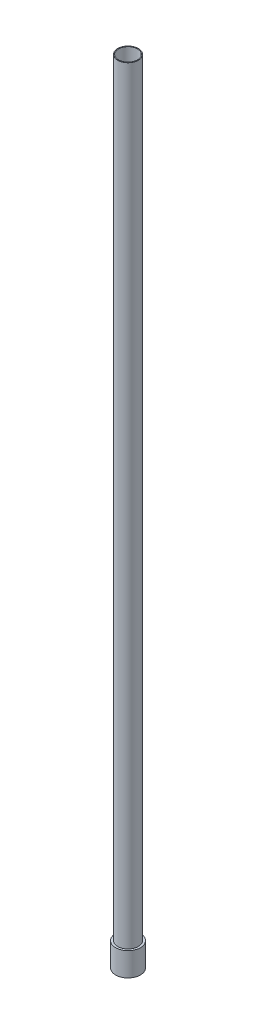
from build123d import *


with BuildPart() as part:
    # Sketch2 → Revolve1 (revolve)
    with BuildSketch(Plane.XY, mode=Mode.PRIVATE) as revolve1_sk:
        Polygon((-3.6576, 0), (-4.7625, 0), (-4.7625, 9.1186), (-3.9624, 9.1186), (-3.9624, 304.8), (-3.6576, 304.8), align=None)
    revolve(revolve1_sk.sketch.rotate(Axis((0, 0, 0), (0, 1, 0)), 270), axis=Axis((0, 0, 0), (0, 1, 0)))


solid = part.part
